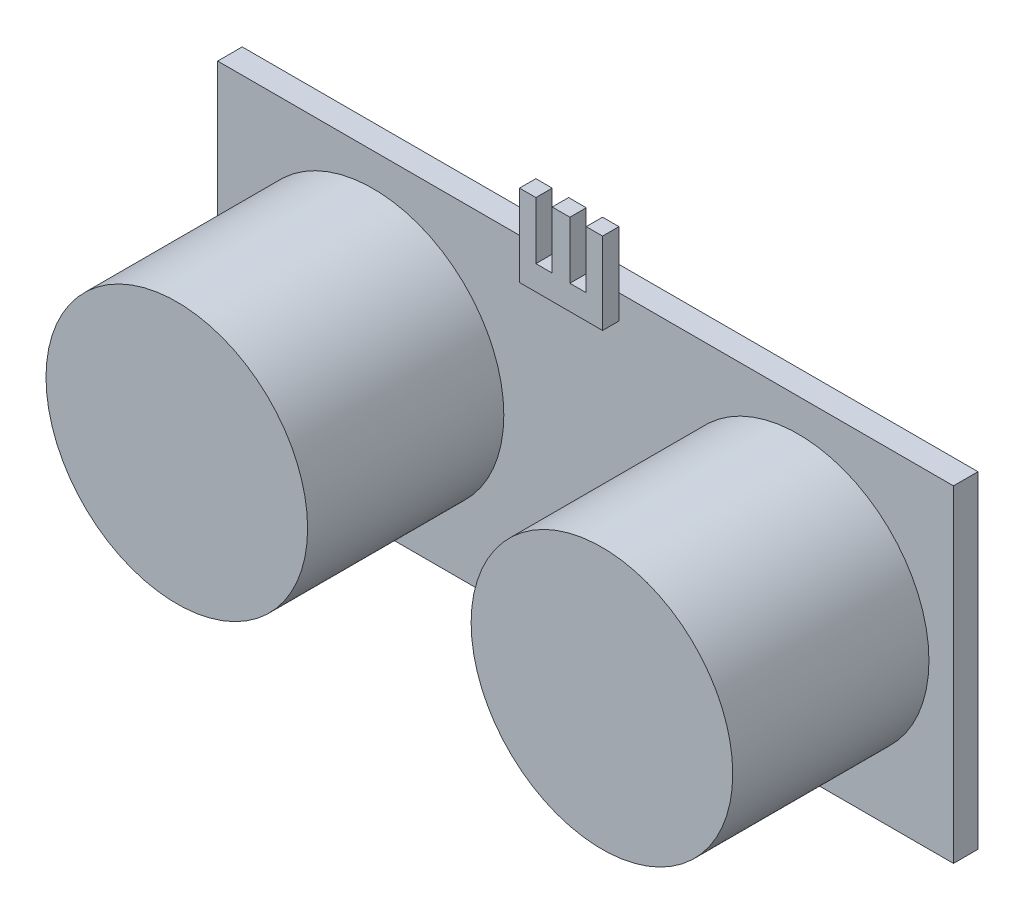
from build123d import *

# Parameters (mm, degrees)
SKETCH1_W           = 45
SKETCH1_H           = 20
BOSS_EXTRUDE1_DEPTH = 1.5
SKETCH2_R           = 8
BOSS_EXTRUDE2_DEPTH = 12
SKETCH3_W           = 5.08
SKETCH3_H           = 5
BOSS_EXTRUDE3_DEPTH = 1
SKETCH4_W           = 1
SKETCH4_H           = 3.5
CUT_EXTRUDE1_DEPTH  = 1


with BuildPart() as part:
    # Sketch1 → Boss-Extrude1 (new body)
    with BuildSketch(Plane.XY):
        Rectangle(SKETCH1_W, SKETCH1_H)
    extrude(amount=BOSS_EXTRUDE1_DEPTH)

    # Sketch2 → Boss-Extrude2 (add)
    with BuildSketch(Plane.XY.offset(1.5)):
        with Locations((-13, 0)):
            Circle(SKETCH2_R)
        with Locations((13, 0)):
            Circle(SKETCH2_R)
    extrude(amount=BOSS_EXTRUDE2_DEPTH)

    # Sketch3 → Boss-Extrude3 (add)
    with BuildSketch(Plane.XY.offset(1.5)):
        with Locations((-0.5, 11)):
            Rectangle(SKETCH3_W, SKETCH3_H)
    extrude(amount=BOSS_EXTRUDE3_DEPTH)

    # Sketch4 → Cut-Extrude1 (cut)
    with BuildSketch(Plane(origin=(0, 0, 1.5), x_dir=(-1, 0, 0), z_dir=(0, 0, -1))):
        with Locations((-0.54, 11.75)):
            Rectangle(SKETCH4_W, SKETCH4_H)
        with Locations((1.54, 11.75)):
            Rectangle(SKETCH4_W, SKETCH4_H)
    extrude(amount=-CUT_EXTRUDE1_DEPTH, mode=Mode.SUBTRACT)


solid = part.part
